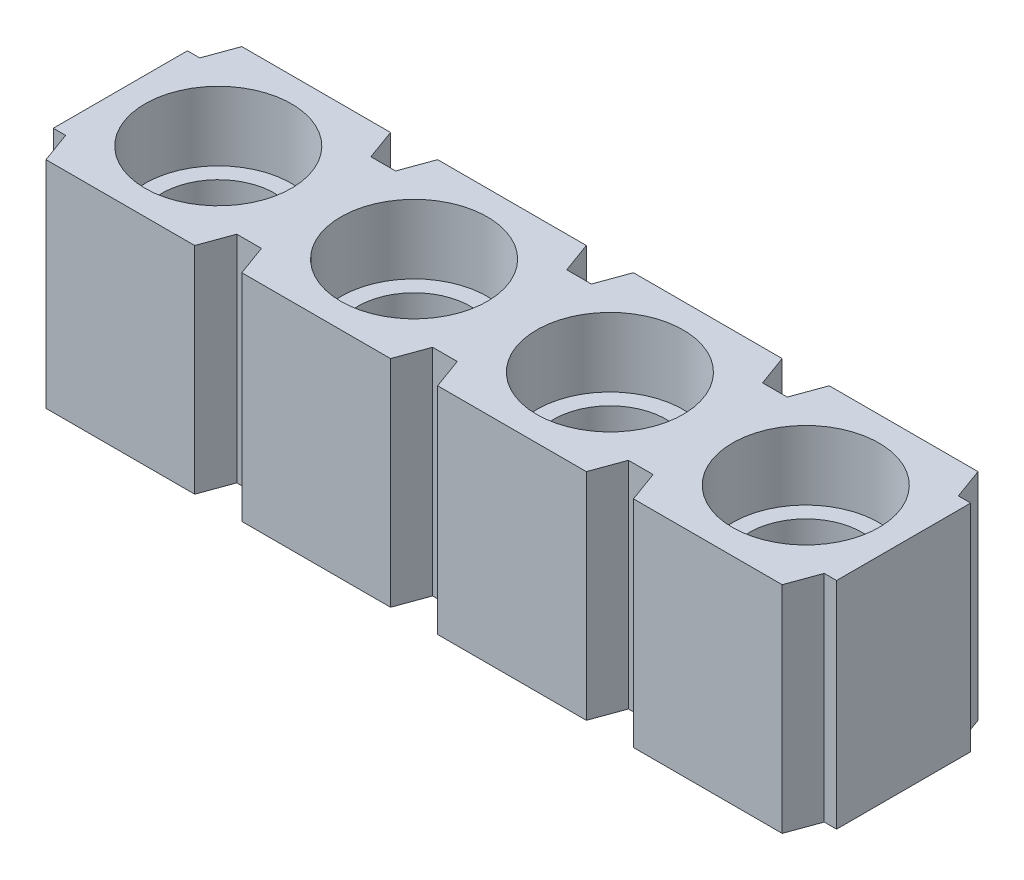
ISO-10303-21;
HEADER;
FILE_DESCRIPTION(('STEP AP214'),'2;1');
FILE_NAME('part.step','',(''),(''),'','','');
FILE_SCHEMA(('AUTOMOTIVE_DESIGN { 1 0 10303 214 1 1 1 1 }'));
ENDSEC;
DATA;
#1=APPLICATION_CONTEXT('core data for automotive mechanical design processes');
#2=APPLICATION_PROTOCOL_DEFINITION('international standard','automotive_design',2000,#1);
#3=PRODUCT_CONTEXT('',#1,'mechanical');
#4=PRODUCT('Part','Part','',(#3));
#5=PRODUCT_RELATED_PRODUCT_CATEGORY('part','',(#4));
#6=PRODUCT_DEFINITION_FORMATION('','',#4);
#7=PRODUCT_DEFINITION_CONTEXT('part definition',#1,'design');
#8=PRODUCT_DEFINITION('design','',#6,#7);
#9=PRODUCT_DEFINITION_SHAPE('','',#8);
#10=(LENGTH_UNIT() NAMED_UNIT(*) SI_UNIT(.MILLI.,.METRE.));
#11=(NAMED_UNIT(*) PLANE_ANGLE_UNIT() SI_UNIT($,.RADIAN.));
#12=(NAMED_UNIT(*) SI_UNIT($,.STERADIAN.) SOLID_ANGLE_UNIT());
#13=UNCERTAINTY_MEASURE_WITH_UNIT(LENGTH_MEASURE(1.E-05),#10,'distance_accuracy_value','');
#14=(GEOMETRIC_REPRESENTATION_CONTEXT(3) GLOBAL_UNCERTAINTY_ASSIGNED_CONTEXT((#13)) GLOBAL_UNIT_ASSIGNED_CONTEXT((#10,
#11,#12)) REPRESENTATION_CONTEXT('',''));
#15=CARTESIAN_POINT('',(0.,0.,0.));
#16=DIRECTION('',(0.,0.,1.));
#17=DIRECTION('',(1.,0.,0.));
#18=AXIS2_PLACEMENT_3D('',#15,#16,#17);
#19=CARTESIAN_POINT('',(9.54874741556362,-2.794,-2.54));
#20=DIRECTION('',(0.,0.,-1.));
#21=DIRECTION('',(-1.,0.,0.));
#22=AXIS2_PLACEMENT_3D('',#19,#20,#21);
#23=PLANE('',#22);
#24=DIRECTION('',(0.,1.,0.));
#25=VECTOR('',#24,1.);
#26=CARTESIAN_POINT('',(7.00877281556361,-2.794,-2.54));
#27=LINE('',#26,#25);
#28=CARTESIAN_POINT('',(7.00877281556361,-2.794,-2.54));
#29=VERTEX_POINT('',#28);
#30=CARTESIAN_POINT('',(7.00877281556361,0.,-2.54));
#31=VERTEX_POINT('',#30);
#32=EDGE_CURVE('E279',#29,#31,#27,.T.);
#33=ORIENTED_EDGE('',*,*,#32,.F.);
#34=DIRECTION('',(-1.,0.,0.));
#35=VECTOR('',#34,1.);
#36=CARTESIAN_POINT('',(9.54874741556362,-2.794,-2.54));
#37=LINE('',#36,#35);
#38=CARTESIAN_POINT('',(5.0799746,-2.794,-2.54));
#39=VERTEX_POINT('',#38);
#40=EDGE_CURVE('E270',#29,#39,#37,.T.);
#41=ORIENTED_EDGE('',*,*,#40,.T.);
#42=DIRECTION('',(0.,1.,0.));
#43=VECTOR('',#42,1.);
#44=CARTESIAN_POINT('',(5.0799746,-2.794,-2.54));
#45=LINE('',#44,#43);
#46=CARTESIAN_POINT('',(5.0799746,0.,-2.54));
#47=VERTEX_POINT('',#46);
#48=EDGE_CURVE('E329',#39,#47,#45,.T.);
#49=ORIENTED_EDGE('',*,*,#48,.T.);
#50=DIRECTION('',(-1.,0.,0.));
#51=VECTOR('',#50,1.);
#52=CARTESIAN_POINT('',(9.54874741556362,0.,-2.54));
#53=LINE('',#52,#51);
#54=EDGE_CURVE('E542',#31,#47,#53,.T.);
#55=ORIENTED_EDGE('',*,*,#54,.F.);
#56=EDGE_LOOP('',(#33,#41,#49,#55));
#57=FACE_BOUND('',#56,.T.);
#58=ADVANCED_FACE('F15',(#57),#23,.T.);
#59=CARTESIAN_POINT('',(0.,-2.794,0.));
#60=DIRECTION('',(0.,0.,1.));
#61=DIRECTION('',(1.,0.,0.));
#62=AXIS2_PLACEMENT_3D('',#59,#60,#61);
#63=PLANE('',#62);
#64=DIRECTION('',(0.,1.,0.));
#65=VECTOR('',#64,1.);
#66=CARTESIAN_POINT('',(7.6199746,-2.794,0.));
#67=LINE('',#66,#65);
#68=CARTESIAN_POINT('',(7.6199746,-2.794,0.));
#69=VERTEX_POINT('',#68);
#70=CARTESIAN_POINT('',(7.6199746,0.,0.));
#71=VERTEX_POINT('',#70);
#72=EDGE_CURVE('E301',#69,#71,#67,.T.);
#73=ORIENTED_EDGE('',*,*,#72,.F.);
#74=DIRECTION('',(1.,0.,0.));
#75=VECTOR('',#74,1.);
#76=CARTESIAN_POINT('',(0.,-2.794,0.));
#77=LINE('',#76,#75);
#78=CARTESIAN_POINT('',(9.54874741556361,-2.794,0.));
#79=VERTEX_POINT('',#78);
#80=EDGE_CURVE('E486',#69,#79,#77,.T.);
#81=ORIENTED_EDGE('',*,*,#80,.T.);
#82=DIRECTION('',(0.,1.,0.));
#83=VECTOR('',#82,1.);
#84=CARTESIAN_POINT('',(9.54874741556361,-2.794,0.));
#85=LINE('',#84,#83);
#86=CARTESIAN_POINT('',(9.54874741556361,0.,0.));
#87=VERTEX_POINT('',#86);
#88=EDGE_CURVE('E555',#79,#87,#85,.T.);
#89=ORIENTED_EDGE('',*,*,#88,.T.);
#90=DIRECTION('',(1.,0.,0.));
#91=VECTOR('',#90,1.);
#92=CARTESIAN_POINT('',(0.,0.,0.));
#93=LINE('',#92,#91);
#94=EDGE_CURVE('E522',#71,#87,#93,.T.);
#95=ORIENTED_EDGE('',*,*,#94,.F.);
#96=EDGE_LOOP('',(#73,#81,#89,#95));
#97=FACE_BOUND('',#96,.T.);
#98=ADVANCED_FACE('F628',(#97),#63,.T.);
#99=DIRECTION('',(0.,1.,0.));
#100=VECTOR('',#99,1.);
#101=CARTESIAN_POINT('',(4.46877281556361,-2.794,-2.54));
#102=LINE('',#101,#100);
#103=CARTESIAN_POINT('',(4.46877281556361,-2.794,-2.54));
#104=VERTEX_POINT('',#103);
#105=CARTESIAN_POINT('',(4.46877281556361,0.,-2.54));
#106=VERTEX_POINT('',#105);
#107=EDGE_CURVE('E326',#104,#106,#102,.T.);
#108=ORIENTED_EDGE('',*,*,#107,.F.);
#109=CARTESIAN_POINT('',(2.5399746,-2.794,-2.54));
#110=VERTEX_POINT('',#109);
#111=EDGE_CURVE('E823',#104,#110,#37,.T.);
#112=ORIENTED_EDGE('',*,*,#111,.T.);
#113=DIRECTION('',(0.,1.,0.));
#114=VECTOR('',#113,1.);
#115=CARTESIAN_POINT('',(2.5399746,-2.794,-2.54));
#116=LINE('',#115,#114);
#117=CARTESIAN_POINT('',(2.5399746,0.,-2.54));
#118=VERTEX_POINT('',#117);
#119=EDGE_CURVE('E420',#110,#118,#116,.T.);
#120=ORIENTED_EDGE('',*,*,#119,.T.);
#121=EDGE_CURVE('E580',#106,#118,#53,.T.);
#122=ORIENTED_EDGE('',*,*,#121,.F.);
#123=EDGE_LOOP('',(#108,#112,#120,#122));
#124=FACE_BOUND('',#123,.T.);
#125=ADVANCED_FACE('F697',(#124),#23,.T.);
#126=DIRECTION('',(0.,1.,0.));
#127=VECTOR('',#126,1.);
#128=CARTESIAN_POINT('',(7.00877281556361,-2.794,0.));
#129=LINE('',#128,#127);
#130=CARTESIAN_POINT('',(7.00877281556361,-2.794,0.));
#131=VERTEX_POINT('',#130);
#132=CARTESIAN_POINT('',(7.00877281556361,0.,0.));
#133=VERTEX_POINT('',#132);
#134=EDGE_CURVE('E304',#131,#133,#129,.T.);
#135=ORIENTED_EDGE('',*,*,#134,.T.);
#136=CARTESIAN_POINT('',(5.0799746,0.,0.));
#137=VERTEX_POINT('',#136);
#138=EDGE_CURVE('E617',#137,#133,#93,.T.);
#139=ORIENTED_EDGE('',*,*,#138,.F.);
#140=DIRECTION('',(0.,1.,0.));
#141=VECTOR('',#140,1.);
#142=CARTESIAN_POINT('',(5.0799746,-2.794,0.));
#143=LINE('',#142,#141);
#144=CARTESIAN_POINT('',(5.0799746,-2.794,0.));
#145=VERTEX_POINT('',#144);
#146=EDGE_CURVE('E352',#145,#137,#143,.T.);
#147=ORIENTED_EDGE('',*,*,#146,.F.);
#148=EDGE_CURVE('E658',#145,#131,#77,.T.);
#149=ORIENTED_EDGE('',*,*,#148,.T.);
#150=EDGE_LOOP('',(#135,#139,#147,#149));
#151=FACE_BOUND('',#150,.T.);
#152=ADVANCED_FACE('F672',(#151),#63,.T.);
#153=DIRECTION('',(0.,1.,0.));
#154=VECTOR('',#153,1.);
#155=CARTESIAN_POINT('',(1.92877281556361,-2.794,-2.54));
#156=LINE('',#155,#154);
#157=CARTESIAN_POINT('',(1.92877281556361,-2.794,-2.54));
#158=VERTEX_POINT('',#157);
#159=CARTESIAN_POINT('',(1.92877281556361,0.,-2.54));
#160=VERTEX_POINT('',#159);
#161=EDGE_CURVE('E417',#158,#160,#156,.T.);
#162=ORIENTED_EDGE('',*,*,#161,.F.);
#163=CARTESIAN_POINT('',(0.,-2.794,-2.54));
#164=VERTEX_POINT('',#163);
#165=EDGE_CURVE('E504',#158,#164,#37,.T.);
#166=ORIENTED_EDGE('',*,*,#165,.T.);
#167=DIRECTION('',(0.,1.,0.));
#168=VECTOR('',#167,1.);
#169=CARTESIAN_POINT('',(0.,-2.794,-2.54));
#170=LINE('',#169,#168);
#171=CARTESIAN_POINT('',(0.,0.,-2.54));
#172=VERTEX_POINT('',#171);
#173=EDGE_CURVE('E10',#164,#172,#170,.T.);
#174=ORIENTED_EDGE('',*,*,#173,.T.);
#175=EDGE_CURVE('E540',#160,#172,#53,.T.);
#176=ORIENTED_EDGE('',*,*,#175,.F.);
#177=EDGE_LOOP('',(#162,#166,#174,#176));
#178=FACE_BOUND('',#177,.T.);
#179=ADVANCED_FACE('F581',(#178),#23,.T.);
#180=DIRECTION('',(0.,1.,0.));
#181=VECTOR('',#180,1.);
#182=CARTESIAN_POINT('',(4.46877281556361,-2.794,0.));
#183=LINE('',#182,#181);
#184=CARTESIAN_POINT('',(4.46877281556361,-2.794,0.));
#185=VERTEX_POINT('',#184);
#186=CARTESIAN_POINT('',(4.46877281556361,0.,0.));
#187=VERTEX_POINT('',#186);
#188=EDGE_CURVE('E355',#185,#187,#183,.T.);
#189=ORIENTED_EDGE('',*,*,#188,.T.);
#190=CARTESIAN_POINT('',(2.5399746,0.,0.));
#191=VERTEX_POINT('',#190);
#192=EDGE_CURVE('E527',#191,#187,#93,.T.);
#193=ORIENTED_EDGE('',*,*,#192,.F.);
#194=DIRECTION('',(0.,1.,0.));
#195=VECTOR('',#194,1.);
#196=CARTESIAN_POINT('',(2.5399746,-2.794,0.));
#197=LINE('',#196,#195);
#198=CARTESIAN_POINT('',(2.5399746,-2.794,0.));
#199=VERTEX_POINT('',#198);
#200=EDGE_CURVE('E445',#199,#191,#197,.T.);
#201=ORIENTED_EDGE('',*,*,#200,.F.);
#202=EDGE_CURVE('E491',#199,#185,#77,.T.);
#203=ORIENTED_EDGE('',*,*,#202,.T.);
#204=EDGE_LOOP('',(#189,#193,#201,#203));
#205=FACE_BOUND('',#204,.T.);
#206=ADVANCED_FACE('F614',(#205),#63,.T.);
#207=CARTESIAN_POINT('',(0.,-2.794,-2.54));
#208=DIRECTION('',(-0.93969262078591,0.,-0.342020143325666));
#209=DIRECTION('',(-0.342020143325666,0.,0.93969262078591));
#210=AXIS2_PLACEMENT_3D('',#207,#208,#209);
#211=PLANE('',#210);
#212=DIRECTION('',(-0.342020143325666,0.,0.939692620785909));
#213=VECTOR('',#212,1.);
#214=CARTESIAN_POINT('',(0.,0.,-2.54));
#215=LINE('',#214,#213);
#216=CARTESIAN_POINT('',(-0.145606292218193,0.,-2.13995));
#217=VERTEX_POINT('',#216);
#218=EDGE_CURVE('E469',#172,#217,#215,.T.);
#219=ORIENTED_EDGE('',*,*,#218,.F.);
#220=ORIENTED_EDGE('',*,*,#173,.F.);
#221=DIRECTION('',(-0.342020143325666,0.,0.939692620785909));
#222=VECTOR('',#221,1.);
#223=CARTESIAN_POINT('',(0.,-2.794,-2.54));
#224=LINE('',#223,#222);
#225=CARTESIAN_POINT('',(-0.145606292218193,-2.794,-2.13995));
#226=VERTEX_POINT('',#225);
#227=EDGE_CURVE('E470',#164,#226,#224,.T.);
#228=ORIENTED_EDGE('',*,*,#227,.T.);
#229=DIRECTION('',(0.,1.,0.));
#230=VECTOR('',#229,1.);
#231=CARTESIAN_POINT('',(-0.145606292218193,-2.794,-2.13995));
#232=LINE('',#231,#230);
#233=EDGE_CURVE('E19',#226,#217,#232,.T.);
#234=ORIENTED_EDGE('',*,*,#233,.T.);
#235=EDGE_LOOP('',(#219,#220,#228,#234));
#236=FACE_BOUND('',#235,.T.);
#237=ADVANCED_FACE('F17',(#236),#211,.T.);
#238=DIRECTION('',(0.,1.,0.));
#239=VECTOR('',#238,1.);
#240=CARTESIAN_POINT('',(7.6199746,-2.794,-2.54));
#241=LINE('',#240,#239);
#242=CARTESIAN_POINT('',(7.6199746,-2.794,-2.54));
#243=VERTEX_POINT('',#242);
#244=CARTESIAN_POINT('',(7.6199746,0.,-2.54));
#245=VERTEX_POINT('',#244);
#246=EDGE_CURVE('E281',#243,#245,#241,.T.);
#247=ORIENTED_EDGE('',*,*,#246,.T.);
#248=CARTESIAN_POINT('',(9.54874741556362,0.,-2.54));
#249=VERTEX_POINT('',#248);
#250=EDGE_CURVE('E474',#249,#245,#53,.T.);
#251=ORIENTED_EDGE('',*,*,#250,.F.);
#252=DIRECTION('',(0.,1.,0.));
#253=VECTOR('',#252,1.);
#254=CARTESIAN_POINT('',(9.54874741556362,-2.794,-2.54));
#255=LINE('',#254,#253);
#256=CARTESIAN_POINT('',(9.54874741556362,-2.794,-2.54));
#257=VERTEX_POINT('',#256);
#258=EDGE_CURVE('E24',#257,#249,#255,.T.);
#259=ORIENTED_EDGE('',*,*,#258,.F.);
#260=EDGE_CURVE('E505',#257,#243,#37,.T.);
#261=ORIENTED_EDGE('',*,*,#260,.T.);
#262=EDGE_LOOP('',(#247,#251,#259,#261));
#263=FACE_BOUND('',#262,.T.);
#264=ADVANCED_FACE('F654',(#263),#23,.T.);
#265=CARTESIAN_POINT('',(9.54874741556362,-2.794,-2.54));
#266=DIRECTION('',(0.939692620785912,0.,-0.34202014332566));
#267=DIRECTION('',(-0.34202014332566,0.,-0.939692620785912));
#268=AXIS2_PLACEMENT_3D('',#265,#266,#267);
#269=PLANE('',#268);
#270=DIRECTION('',(-0.34202014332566,0.,-0.939692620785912));
#271=VECTOR('',#270,1.);
#272=CARTESIAN_POINT('',(9.54874741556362,0.,-2.54));
#273=LINE('',#272,#271);
#274=CARTESIAN_POINT('',(9.69435370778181,0.,-2.13995));
#275=VERTEX_POINT('',#274);
#276=EDGE_CURVE('E537',#275,#249,#273,.T.);
#277=ORIENTED_EDGE('',*,*,#276,.F.);
#278=DIRECTION('',(0.,1.,0.));
#279=VECTOR('',#278,1.);
#280=CARTESIAN_POINT('',(9.69435370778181,-2.794,-2.13995));
#281=LINE('',#280,#279);
#282=CARTESIAN_POINT('',(9.69435370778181,-2.794,-2.13995));
#283=VERTEX_POINT('',#282);
#284=EDGE_CURVE('E545',#283,#275,#281,.T.);
#285=ORIENTED_EDGE('',*,*,#284,.F.);
#286=DIRECTION('',(-0.34202014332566,0.,-0.939692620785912));
#287=VECTOR('',#286,1.);
#288=CARTESIAN_POINT('',(9.54874741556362,-2.794,-2.54));
#289=LINE('',#288,#287);
#290=EDGE_CURVE('E501',#283,#257,#289,.T.);
#291=ORIENTED_EDGE('',*,*,#290,.T.);
#292=ORIENTED_EDGE('',*,*,#258,.T.);
#293=EDGE_LOOP('',(#277,#285,#291,#292));
#294=FACE_BOUND('',#293,.T.);
#295=ADVANCED_FACE('F650',(#294),#269,.T.);
#296=CARTESIAN_POINT('',(9.85437370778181,-2.794,-2.13995));
#297=DIRECTION('',(0.,0.,-1.));
#298=DIRECTION('',(-1.,0.,0.));
#299=AXIS2_PLACEMENT_3D('',#296,#297,#298);
#300=PLANE('',#299);
#301=ORIENTED_EDGE('',*,*,#284,.T.);
#302=DIRECTION('',(-1.,0.,0.));
#303=VECTOR('',#302,1.);
#304=CARTESIAN_POINT('',(9.85437370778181,0.,-2.13995));
#305=LINE('',#304,#303);
#306=CARTESIAN_POINT('',(9.85437370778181,0.,-2.13995));
#307=VERTEX_POINT('',#306);
#308=EDGE_CURVE('E535',#307,#275,#305,.T.);
#309=ORIENTED_EDGE('',*,*,#308,.F.);
#310=DIRECTION('',(0.,1.,0.));
#311=VECTOR('',#310,1.);
#312=CARTESIAN_POINT('',(9.85437370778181,-2.794,-2.13995));
#313=LINE('',#312,#311);
#314=CARTESIAN_POINT('',(9.85437370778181,-2.794,-2.13995));
#315=VERTEX_POINT('',#314);
#316=EDGE_CURVE('E548',#315,#307,#313,.T.);
#317=ORIENTED_EDGE('',*,*,#316,.F.);
#318=DIRECTION('',(-1.,0.,0.));
#319=VECTOR('',#318,1.);
#320=CARTESIAN_POINT('',(9.85437370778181,-2.794,-2.13995));
#321=LINE('',#320,#319);
#322=EDGE_CURVE('E499',#315,#283,#321,.T.);
#323=ORIENTED_EDGE('',*,*,#322,.T.);
#324=EDGE_LOOP('',(#301,#309,#317,#323));
#325=FACE_BOUND('',#324,.T.);
#326=ADVANCED_FACE('F645',(#325),#300,.T.);
#327=CARTESIAN_POINT('',(9.85437370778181,-2.794,-2.13995));
#328=DIRECTION('',(1.,0.,0.));
#329=DIRECTION('',(0.,0.,-1.));
#330=AXIS2_PLACEMENT_3D('',#327,#328,#329);
#331=PLANE('',#330);
#332=DIRECTION('',(0.,0.,-1.));
#333=VECTOR('',#332,1.);
#334=CARTESIAN_POINT('',(9.85437370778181,0.,-2.13995));
#335=LINE('',#334,#333);
#336=CARTESIAN_POINT('',(9.85437370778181,0.,-0.40005));
#337=VERTEX_POINT('',#336);
#338=EDGE_CURVE('E532',#337,#307,#335,.T.);
#339=ORIENTED_EDGE('',*,*,#338,.F.);
#340=DIRECTION('',(0.,1.,0.));
#341=VECTOR('',#340,1.);
#342=CARTESIAN_POINT('',(9.85437370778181,-2.794,-0.40005));
#343=LINE('',#342,#341);
#344=CARTESIAN_POINT('',(9.85437370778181,-2.794,-0.40005));
#345=VERTEX_POINT('',#344);
#346=EDGE_CURVE('E550',#345,#337,#343,.T.);
#347=ORIENTED_EDGE('',*,*,#346,.F.);
#348=DIRECTION('',(0.,0.,-1.));
#349=VECTOR('',#348,1.);
#350=CARTESIAN_POINT('',(9.85437370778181,-2.794,-2.13995));
#351=LINE('',#350,#349);
#352=EDGE_CURVE('E496',#345,#315,#351,.T.);
#353=ORIENTED_EDGE('',*,*,#352,.T.);
#354=ORIENTED_EDGE('',*,*,#316,.T.);
#355=EDGE_LOOP('',(#339,#347,#353,#354));
#356=FACE_BOUND('',#355,.T.);
#357=ADVANCED_FACE('F641',(#356),#331,.T.);
#358=CARTESIAN_POINT('',(9.85437370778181,-2.794,-0.40005));
#359=DIRECTION('',(0.,0.,1.));
#360=DIRECTION('',(1.,0.,0.));
#361=AXIS2_PLACEMENT_3D('',#358,#359,#360);
#362=PLANE('',#361);
#363=DIRECTION('',(1.,0.,0.));
#364=VECTOR('',#363,1.);
#365=CARTESIAN_POINT('',(9.85437370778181,-2.794,-0.40005));
#366=LINE('',#365,#364);
#367=CARTESIAN_POINT('',(9.69435370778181,-2.794,-0.40005));
#368=VERTEX_POINT('',#367);
#369=EDGE_CURVE('E494',#368,#345,#366,.T.);
#370=ORIENTED_EDGE('',*,*,#369,.T.);
#371=ORIENTED_EDGE('',*,*,#346,.T.);
#372=DIRECTION('',(1.,0.,0.));
#373=VECTOR('',#372,1.);
#374=CARTESIAN_POINT('',(9.85437370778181,0.,-0.40005));
#375=LINE('',#374,#373);
#376=CARTESIAN_POINT('',(9.69435370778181,0.,-0.40005));
#377=VERTEX_POINT('',#376);
#378=EDGE_CURVE('E530',#377,#337,#375,.T.);
#379=ORIENTED_EDGE('',*,*,#378,.F.);
#380=DIRECTION('',(0.,1.,0.));
#381=VECTOR('',#380,1.);
#382=CARTESIAN_POINT('',(9.69435370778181,-2.794,-0.40005));
#383=LINE('',#382,#381);
#384=EDGE_CURVE('E553',#368,#377,#383,.T.);
#385=ORIENTED_EDGE('',*,*,#384,.F.);
#386=EDGE_LOOP('',(#370,#371,#379,#385));
#387=FACE_BOUND('',#386,.T.);
#388=ADVANCED_FACE('F636',(#387),#362,.T.);
#389=CARTESIAN_POINT('',(9.54874741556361,-2.794,0.));
#390=DIRECTION('',(0.939692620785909,0.,0.342020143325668));
#391=DIRECTION('',(0.342020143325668,0.,-0.939692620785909));
#392=AXIS2_PLACEMENT_3D('',#389,#390,#391);
#393=PLANE('',#392);
#394=DIRECTION('',(0.342020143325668,0.,-0.939692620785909));
#395=VECTOR('',#394,1.);
#396=CARTESIAN_POINT('',(9.54874741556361,0.,0.));
#397=LINE('',#396,#395);
#398=EDGE_CURVE('E526',#87,#377,#397,.T.);
#399=ORIENTED_EDGE('',*,*,#398,.F.);
#400=ORIENTED_EDGE('',*,*,#88,.F.);
#401=DIRECTION('',(0.342020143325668,0.,-0.939692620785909));
#402=VECTOR('',#401,1.);
#403=CARTESIAN_POINT('',(9.54874741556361,-2.794,0.));
#404=LINE('',#403,#402);
#405=EDGE_CURVE('E490',#79,#368,#404,.T.);
#406=ORIENTED_EDGE('',*,*,#405,.T.);
#407=ORIENTED_EDGE('',*,*,#384,.T.);
#408=EDGE_LOOP('',(#399,#400,#406,#407));
#409=FACE_BOUND('',#408,.T.);
#410=ADVANCED_FACE('F632',(#409),#393,.T.);
#411=DIRECTION('',(0.,1.,0.));
#412=VECTOR('',#411,1.);
#413=CARTESIAN_POINT('',(1.92877281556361,-2.794,0.));
#414=LINE('',#413,#412);
#415=CARTESIAN_POINT('',(1.92877281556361,-2.794,0.));
#416=VERTEX_POINT('',#415);
#417=CARTESIAN_POINT('',(1.92877281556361,0.,0.));
#418=VERTEX_POINT('',#417);
#419=EDGE_CURVE('E449',#416,#418,#414,.T.);
#420=ORIENTED_EDGE('',*,*,#419,.T.);
#421=CARTESIAN_POINT('',(0.,0.,0.));
#422=VERTEX_POINT('',#421);
#423=EDGE_CURVE('E523',#422,#418,#93,.T.);
#424=ORIENTED_EDGE('',*,*,#423,.F.);
#425=DIRECTION('',(0.,1.,0.));
#426=VECTOR('',#425,1.);
#427=CARTESIAN_POINT('',(0.,-2.794,0.));
#428=LINE('',#427,#426);
#429=CARTESIAN_POINT('',(0.,-2.794,0.));
#430=VERTEX_POINT('',#429);
#431=EDGE_CURVE('E558',#430,#422,#428,.T.);
#432=ORIENTED_EDGE('',*,*,#431,.F.);
#433=EDGE_CURVE('E487',#430,#416,#77,.T.);
#434=ORIENTED_EDGE('',*,*,#433,.T.);
#435=EDGE_LOOP('',(#420,#424,#432,#434));
#436=FACE_BOUND('',#435,.T.);
#437=ADVANCED_FACE('F597',(#436),#63,.T.);
#438=CARTESIAN_POINT('',(0.,-2.794,0.));
#439=DIRECTION('',(-0.939692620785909,0.,0.342020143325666));
#440=DIRECTION('',(0.342020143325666,0.,0.939692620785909));
#441=AXIS2_PLACEMENT_3D('',#438,#439,#440);
#442=PLANE('',#441);
#443=DIRECTION('',(0.342020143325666,0.,0.939692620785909));
#444=VECTOR('',#443,1.);
#445=CARTESIAN_POINT('',(0.,0.,0.));
#446=LINE('',#445,#444);
#447=CARTESIAN_POINT('',(-0.145606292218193,0.,-0.40005));
#448=VERTEX_POINT('',#447);
#449=EDGE_CURVE('E519',#448,#422,#446,.T.);
#450=ORIENTED_EDGE('',*,*,#449,.F.);
#451=DIRECTION('',(0.,1.,0.));
#452=VECTOR('',#451,1.);
#453=CARTESIAN_POINT('',(-0.145606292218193,-2.794,-0.40005));
#454=LINE('',#453,#452);
#455=CARTESIAN_POINT('',(-0.145606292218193,-2.794,-0.40005));
#456=VERTEX_POINT('',#455);
#457=EDGE_CURVE('E560',#456,#448,#454,.T.);
#458=ORIENTED_EDGE('',*,*,#457,.F.);
#459=DIRECTION('',(0.342020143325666,0.,0.939692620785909));
#460=VECTOR('',#459,1.);
#461=CARTESIAN_POINT('',(0.,-2.794,0.));
#462=LINE('',#461,#460);
#463=EDGE_CURVE('E483',#456,#430,#462,.T.);
#464=ORIENTED_EDGE('',*,*,#463,.T.);
#465=ORIENTED_EDGE('',*,*,#431,.T.);
#466=EDGE_LOOP('',(#450,#458,#464,#465));
#467=FACE_BOUND('',#466,.T.);
#468=ADVANCED_FACE('F593',(#467),#442,.T.);
#469=CARTESIAN_POINT('',(-0.305626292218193,-2.794,-0.40005));
#470=DIRECTION('',(0.,0.,1.));
#471=DIRECTION('',(1.,0.,0.));
#472=AXIS2_PLACEMENT_3D('',#469,#470,#471);
#473=PLANE('',#472);
#474=DIRECTION('',(1.,0.,0.));
#475=VECTOR('',#474,1.);
#476=CARTESIAN_POINT('',(-0.305626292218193,0.,-0.40005));
#477=LINE('',#476,#475);
#478=CARTESIAN_POINT('',(-0.305626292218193,0.,-0.40005));
#479=VERTEX_POINT('',#478);
#480=EDGE_CURVE('E516',#479,#448,#477,.T.);
#481=ORIENTED_EDGE('',*,*,#480,.F.);
#482=DIRECTION('',(0.,1.,0.));
#483=VECTOR('',#482,1.);
#484=CARTESIAN_POINT('',(-0.305626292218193,-2.794,-0.40005));
#485=LINE('',#484,#483);
#486=CARTESIAN_POINT('',(-0.305626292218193,-2.794,-0.40005));
#487=VERTEX_POINT('',#486);
#488=EDGE_CURVE('E562',#487,#479,#485,.T.);
#489=ORIENTED_EDGE('',*,*,#488,.F.);
#490=DIRECTION('',(1.,0.,0.));
#491=VECTOR('',#490,1.);
#492=CARTESIAN_POINT('',(-0.305626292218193,-2.794,-0.40005));
#493=LINE('',#492,#491);
#494=EDGE_CURVE('E480',#487,#456,#493,.T.);
#495=ORIENTED_EDGE('',*,*,#494,.T.);
#496=ORIENTED_EDGE('',*,*,#457,.T.);
#497=EDGE_LOOP('',(#481,#489,#495,#496));
#498=FACE_BOUND('',#497,.T.);
#499=ADVANCED_FACE('F591',(#498),#473,.T.);
#500=CARTESIAN_POINT('',(-0.305626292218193,-2.794,-2.13995));
#501=DIRECTION('',(-1.,0.,0.));
#502=DIRECTION('',(0.,0.,1.));
#503=AXIS2_PLACEMENT_3D('',#500,#501,#502);
#504=PLANE('',#503);
#505=DIRECTION('',(0.,0.,1.));
#506=VECTOR('',#505,1.);
#507=CARTESIAN_POINT('',(-0.305626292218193,0.,-2.13995));
#508=LINE('',#507,#506);
#509=CARTESIAN_POINT('',(-0.305626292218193,0.,-2.13995));
#510=VERTEX_POINT('',#509);
#511=EDGE_CURVE('E513',#510,#479,#508,.T.);
#512=ORIENTED_EDGE('',*,*,#511,.F.);
#513=DIRECTION('',(0.,1.,0.));
#514=VECTOR('',#513,1.);
#515=CARTESIAN_POINT('',(-0.305626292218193,-2.794,-2.13995));
#516=LINE('',#515,#514);
#517=CARTESIAN_POINT('',(-0.305626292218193,-2.794,-2.13995));
#518=VERTEX_POINT('',#517);
#519=EDGE_CURVE('E563',#518,#510,#516,.T.);
#520=ORIENTED_EDGE('',*,*,#519,.F.);
#521=DIRECTION('',(0.,0.,1.));
#522=VECTOR('',#521,1.);
#523=CARTESIAN_POINT('',(-0.305626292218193,-2.794,-2.13995));
#524=LINE('',#523,#522);
#525=EDGE_CURVE('E477',#518,#487,#524,.T.);
#526=ORIENTED_EDGE('',*,*,#525,.T.);
#527=ORIENTED_EDGE('',*,*,#488,.T.);
#528=EDGE_LOOP('',(#512,#520,#526,#527));
#529=FACE_BOUND('',#528,.T.);
#530=ADVANCED_FACE('F587',(#529),#504,.T.);
#531=CARTESIAN_POINT('',(-0.305626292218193,-2.794,-2.13995));
#532=DIRECTION('',(0.,0.,-1.));
#533=DIRECTION('',(-1.,0.,0.));
#534=AXIS2_PLACEMENT_3D('',#531,#532,#533);
#535=PLANE('',#534);
#536=DIRECTION('',(-1.,0.,0.));
#537=VECTOR('',#536,1.);
#538=CARTESIAN_POINT('',(-0.305626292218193,0.,-2.13995));
#539=LINE('',#538,#537);
#540=EDGE_CURVE('E510',#217,#510,#539,.T.);
#541=ORIENTED_EDGE('',*,*,#540,.F.);
#542=ORIENTED_EDGE('',*,*,#233,.F.);
#543=DIRECTION('',(-1.,0.,0.));
#544=VECTOR('',#543,1.);
#545=CARTESIAN_POINT('',(-0.305626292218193,-2.794,-2.13995));
#546=LINE('',#545,#544);
#547=EDGE_CURVE('E473',#226,#518,#546,.T.);
#548=ORIENTED_EDGE('',*,*,#547,.T.);
#549=ORIENTED_EDGE('',*,*,#519,.T.);
#550=EDGE_LOOP('',(#541,#542,#548,#549));
#551=FACE_BOUND('',#550,.T.);
#552=ADVANCED_FACE('F572',(#551),#535,.T.);
#553=CARTESIAN_POINT('',(0.,-2.794,-2.54));
#554=DIRECTION('',(0.,-1.,0.));
#555=DIRECTION('',(0.,0.,-1.));
#556=AXIS2_PLACEMENT_3D('',#553,#554,#555);
#557=PLANE('',#556);
#558=DIRECTION('',(0.342020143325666,0.,0.939692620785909));
#559=VECTOR('',#558,1.);
#560=CARTESIAN_POINT('',(7.15437910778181,-2.794,-2.13994999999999));
#561=LINE('',#560,#559);
#562=CARTESIAN_POINT('',(7.15437910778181,-2.794,-2.13994999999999));
#563=VERTEX_POINT('',#562);
#564=EDGE_CURVE('E251',#29,#563,#561,.T.);
#565=ORIENTED_EDGE('',*,*,#564,.T.);
#566=DIRECTION('',(1.,0.,0.));
#567=VECTOR('',#566,1.);
#568=CARTESIAN_POINT('',(7.15437910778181,-2.794,-2.13994999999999));
#569=LINE('',#568,#567);
#570=CARTESIAN_POINT('',(7.47436830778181,-2.794,-2.13994999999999));
#571=VERTEX_POINT('',#570);
#572=EDGE_CURVE('E260',#563,#571,#569,.T.);
#573=ORIENTED_EDGE('',*,*,#572,.T.);
#574=DIRECTION('',(0.342020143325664,0.,-0.93969262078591));
#575=VECTOR('',#574,1.);
#576=CARTESIAN_POINT('',(7.47436830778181,-2.794,-2.13994999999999));
#577=LINE('',#576,#575);
#578=EDGE_CURVE('E257',#571,#243,#577,.T.);
#579=ORIENTED_EDGE('',*,*,#578,.T.);
#580=ORIENTED_EDGE('',*,*,#260,.F.);
#581=ORIENTED_EDGE('',*,*,#290,.F.);
#582=ORIENTED_EDGE('',*,*,#322,.F.);
#583=ORIENTED_EDGE('',*,*,#352,.F.);
#584=ORIENTED_EDGE('',*,*,#369,.F.);
#585=ORIENTED_EDGE('',*,*,#405,.F.);
#586=ORIENTED_EDGE('',*,*,#80,.F.);
#587=DIRECTION('',(-0.342020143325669,0.,-0.939692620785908));
#588=VECTOR('',#587,1.);
#589=CARTESIAN_POINT('',(7.47436830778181,-2.794,-0.40005));
#590=LINE('',#589,#588);
#591=CARTESIAN_POINT('',(7.47436830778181,-2.794,-0.40005));
#592=VERTEX_POINT('',#591);
#593=EDGE_CURVE('E285',#69,#592,#590,.T.);
#594=ORIENTED_EDGE('',*,*,#593,.T.);
#595=DIRECTION('',(-1.,0.,0.));
#596=VECTOR('',#595,1.);
#597=CARTESIAN_POINT('',(7.15437910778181,-2.794,-0.40005));
#598=LINE('',#597,#596);
#599=CARTESIAN_POINT('',(7.15437910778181,-2.794,-0.40005));
#600=VERTEX_POINT('',#599);
#601=EDGE_CURVE('E288',#592,#600,#598,.T.);
#602=ORIENTED_EDGE('',*,*,#601,.T.);
#603=DIRECTION('',(-0.342020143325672,0.,0.939692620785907));
#604=VECTOR('',#603,1.);
#605=CARTESIAN_POINT('',(7.15437910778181,-2.794,-0.40005));
#606=LINE('',#605,#604);
#607=EDGE_CURVE('E292',#600,#131,#606,.T.);
#608=ORIENTED_EDGE('',*,*,#607,.T.);
#609=ORIENTED_EDGE('',*,*,#148,.F.);
#610=DIRECTION('',(-0.342020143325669,0.,-0.939692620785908));
#611=VECTOR('',#610,1.);
#612=CARTESIAN_POINT('',(4.93436830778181,-2.794,-0.40005));
#613=LINE('',#612,#611);
#614=CARTESIAN_POINT('',(4.93436830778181,-2.794,-0.40005));
#615=VERTEX_POINT('',#614);
#616=EDGE_CURVE('E336',#145,#615,#613,.T.);
#617=ORIENTED_EDGE('',*,*,#616,.T.);
#618=DIRECTION('',(-1.,0.,0.));
#619=VECTOR('',#618,1.);
#620=CARTESIAN_POINT('',(4.61437910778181,-2.794,-0.40005));
#621=LINE('',#620,#619);
#622=CARTESIAN_POINT('',(4.61437910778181,-2.794,-0.40005));
#623=VERTEX_POINT('',#622);
#624=EDGE_CURVE('E339',#615,#623,#621,.T.);
#625=ORIENTED_EDGE('',*,*,#624,.T.);
#626=DIRECTION('',(-0.342020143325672,0.,0.939692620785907));
#627=VECTOR('',#626,1.);
#628=CARTESIAN_POINT('',(4.61437910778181,-2.794,-0.40005));
#629=LINE('',#628,#627);
#630=EDGE_CURVE('E343',#623,#185,#629,.T.);
#631=ORIENTED_EDGE('',*,*,#630,.T.);
#632=ORIENTED_EDGE('',*,*,#202,.F.);
#633=DIRECTION('',(-0.342020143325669,0.,-0.939692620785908));
#634=VECTOR('',#633,1.);
#635=CARTESIAN_POINT('',(2.39436830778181,-2.794,-0.40005));
#636=LINE('',#635,#634);
#637=CARTESIAN_POINT('',(2.39436830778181,-2.794,-0.40005));
#638=VERTEX_POINT('',#637);
#639=EDGE_CURVE('E429',#199,#638,#636,.T.);
#640=ORIENTED_EDGE('',*,*,#639,.T.);
#641=DIRECTION('',(-1.,0.,0.));
#642=VECTOR('',#641,1.);
#643=CARTESIAN_POINT('',(2.07437910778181,-2.794,-0.40005));
#644=LINE('',#643,#642);
#645=CARTESIAN_POINT('',(2.07437910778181,-2.794,-0.40005));
#646=VERTEX_POINT('',#645);
#647=EDGE_CURVE('E432',#638,#646,#644,.T.);
#648=ORIENTED_EDGE('',*,*,#647,.T.);
#649=DIRECTION('',(-0.342020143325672,0.,0.939692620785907));
#650=VECTOR('',#649,1.);
#651=CARTESIAN_POINT('',(2.07437910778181,-2.794,-0.40005));
#652=LINE('',#651,#650);
#653=EDGE_CURVE('E436',#646,#416,#652,.T.);
#654=ORIENTED_EDGE('',*,*,#653,.T.);
#655=ORIENTED_EDGE('',*,*,#433,.F.);
#656=ORIENTED_EDGE('',*,*,#463,.F.);
#657=ORIENTED_EDGE('',*,*,#494,.F.);
#658=ORIENTED_EDGE('',*,*,#525,.F.);
#659=ORIENTED_EDGE('',*,*,#547,.F.);
#660=ORIENTED_EDGE('',*,*,#227,.F.);
#661=ORIENTED_EDGE('',*,*,#165,.F.);
#662=DIRECTION('',(0.342020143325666,0.,0.939692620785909));
#663=VECTOR('',#662,1.);
#664=CARTESIAN_POINT('',(2.07437910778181,-2.794,-2.13994999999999));
#665=LINE('',#664,#663);
#666=CARTESIAN_POINT('',(2.07437910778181,-2.794,-2.13994999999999));
#667=VERTEX_POINT('',#666);
#668=EDGE_CURVE('E400',#158,#667,#665,.T.);
#669=ORIENTED_EDGE('',*,*,#668,.T.);
#670=DIRECTION('',(1.,0.,0.));
#671=VECTOR('',#670,1.);
#672=CARTESIAN_POINT('',(2.07437910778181,-2.794,-2.13994999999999));
#673=LINE('',#672,#671);
#674=CARTESIAN_POINT('',(2.39436830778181,-2.794,-2.13994999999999));
#675=VERTEX_POINT('',#674);
#676=EDGE_CURVE('E403',#667,#675,#673,.T.);
#677=ORIENTED_EDGE('',*,*,#676,.T.);
#678=DIRECTION('',(0.342020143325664,0.,-0.93969262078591));
#679=VECTOR('',#678,1.);
#680=CARTESIAN_POINT('',(2.39436830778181,-2.794,-2.13994999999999));
#681=LINE('',#680,#679);
#682=EDGE_CURVE('E407',#675,#110,#681,.T.);
#683=ORIENTED_EDGE('',*,*,#682,.T.);
#684=ORIENTED_EDGE('',*,*,#111,.F.);
#685=DIRECTION('',(0.342020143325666,0.,0.939692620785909));
#686=VECTOR('',#685,1.);
#687=CARTESIAN_POINT('',(4.61437910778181,-2.794,-2.13994999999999));
#688=LINE('',#687,#686);
#689=CARTESIAN_POINT('',(4.61437910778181,-2.794,-2.13994999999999));
#690=VERTEX_POINT('',#689);
#691=EDGE_CURVE('E310',#104,#690,#688,.T.);
#692=ORIENTED_EDGE('',*,*,#691,.T.);
#693=DIRECTION('',(1.,0.,0.));
#694=VECTOR('',#693,1.);
#695=CARTESIAN_POINT('',(4.61437910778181,-2.794,-2.13994999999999));
#696=LINE('',#695,#694);
#697=CARTESIAN_POINT('',(4.93436830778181,-2.794,-2.13994999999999));
#698=VERTEX_POINT('',#697);
#699=EDGE_CURVE('E313',#690,#698,#696,.T.);
#700=ORIENTED_EDGE('',*,*,#699,.T.);
#701=DIRECTION('',(0.342020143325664,0.,-0.93969262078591));
#702=VECTOR('',#701,1.);
#703=CARTESIAN_POINT('',(4.93436830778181,-2.794,-2.13994999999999));
#704=LINE('',#703,#702);
#705=EDGE_CURVE('E317',#698,#39,#704,.T.);
#706=ORIENTED_EDGE('',*,*,#705,.T.);
#707=ORIENTED_EDGE('',*,*,#40,.F.);
#708=EDGE_LOOP('',(#565,#573,#579,#580,#581,#582,#583,#584,#585,#586,#594,#602,#608,#609,#617,
#625,#631,#632,#640,#648,#654,#655,#656,#657,#658,#659,#660,#661,#669,#677,#683,#684,#692,#700,
#706,#707));
#709=FACE_BOUND('',#708,.T.);
#710=CARTESIAN_POINT('',(8.58437370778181,-2.794,-1.27));
#711=DIRECTION('',(0.,1.,0.));
#712=DIRECTION('',(0.,0.,1.));
#713=AXIS2_PLACEMENT_3D('',#710,#711,#712);
#714=CIRCLE('',#713,0.729996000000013);
#715=CARTESIAN_POINT('',(8.58437370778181,-2.794,-0.540003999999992));
#716=VERTEX_POINT('',#715);
#717=EDGE_CURVE('E364',#716,#716,#714,.T.);
#718=ORIENTED_EDGE('',*,*,#717,.T.);
#719=EDGE_LOOP('',(#718));
#720=FACE_BOUND('',#719,.T.);
#721=CARTESIAN_POINT('',(6.04437370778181,-2.794,-1.27));
#722=DIRECTION('',(0.,1.,0.));
#723=DIRECTION('',(0.,0.,1.));
#724=AXIS2_PLACEMENT_3D('',#721,#722,#723);
#725=CIRCLE('',#724,0.729996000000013);
#726=CARTESIAN_POINT('',(6.04437370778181,-2.794,-0.540003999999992));
#727=VERTEX_POINT('',#726);
#728=EDGE_CURVE('E376',#727,#727,#725,.T.);
#729=ORIENTED_EDGE('',*,*,#728,.T.);
#730=EDGE_LOOP('',(#729));
#731=FACE_BOUND('',#730,.T.);
#732=CARTESIAN_POINT('',(3.50437370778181,-2.794,-1.27));
#733=DIRECTION('',(0.,1.,0.));
#734=DIRECTION('',(0.,0.,1.));
#735=AXIS2_PLACEMENT_3D('',#732,#733,#734);
#736=CIRCLE('',#735,0.729996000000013);
#737=CARTESIAN_POINT('',(3.50437370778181,-2.794,-0.540003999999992));
#738=VERTEX_POINT('',#737);
#739=EDGE_CURVE('E388',#738,#738,#736,.T.);
#740=ORIENTED_EDGE('',*,*,#739,.T.);
#741=EDGE_LOOP('',(#740));
#742=FACE_BOUND('',#741,.T.);
#743=CARTESIAN_POINT('',(0.964373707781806,-2.794,-1.27));
#744=DIRECTION('',(0.,1.,0.));
#745=DIRECTION('',(0.,0.,1.));
#746=AXIS2_PLACEMENT_3D('',#743,#744,#745);
#747=CIRCLE('',#746,0.729996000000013);
#748=CARTESIAN_POINT('',(0.964373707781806,-2.794,-0.540003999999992));
#749=VERTEX_POINT('',#748);
#750=EDGE_CURVE('E466',#749,#749,#747,.T.);
#751=ORIENTED_EDGE('',*,*,#750,.T.);
#752=EDGE_LOOP('',(#751));
#753=FACE_BOUND('',#752,.T.);
#754=ADVANCED_FACE('F267',(#709,#720,#731,#742,#753),#557,.T.);
#755=CARTESIAN_POINT('',(0.,0.,-2.54));
#756=DIRECTION('',(0.,-1.,0.));
#757=DIRECTION('',(0.,0.,-1.));
#758=AXIS2_PLACEMENT_3D('',#755,#756,#757);
#759=PLANE('',#758);
#760=CARTESIAN_POINT('',(8.58437370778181,0.,-1.27));
#761=DIRECTION('',(0.,1.,0.));
#762=DIRECTION('',(0.,0.,1.));
#763=AXIS2_PLACEMENT_3D('',#760,#761,#762);
#764=CIRCLE('',#763,0.949960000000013);
#765=CARTESIAN_POINT('',(8.58437370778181,0.,-0.320039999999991));
#766=VERTEX_POINT('',#765);
#767=EDGE_CURVE('E354',#766,#766,#764,.T.);
#768=ORIENTED_EDGE('',*,*,#767,.F.);
#769=EDGE_LOOP('',(#768));
#770=FACE_BOUND('',#769,.T.);
#771=CARTESIAN_POINT('',(6.04437370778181,0.,-1.27));
#772=DIRECTION('',(0.,1.,0.));
#773=DIRECTION('',(0.,0.,1.));
#774=AXIS2_PLACEMENT_3D('',#771,#772,#773);
#775=CIRCLE('',#774,0.949960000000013);
#776=CARTESIAN_POINT('',(6.04437370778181,0.,-0.320039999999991));
#777=VERTEX_POINT('',#776);
#778=EDGE_CURVE('E373',#777,#777,#775,.T.);
#779=ORIENTED_EDGE('',*,*,#778,.F.);
#780=EDGE_LOOP('',(#779));
#781=FACE_BOUND('',#780,.T.);
#782=CARTESIAN_POINT('',(3.50437370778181,0.,-1.27));
#783=DIRECTION('',(0.,1.,0.));
#784=DIRECTION('',(0.,0.,1.));
#785=AXIS2_PLACEMENT_3D('',#782,#783,#784);
#786=CIRCLE('',#785,0.949960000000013);
#787=CARTESIAN_POINT('',(3.50437370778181,0.,-0.320039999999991));
#788=VERTEX_POINT('',#787);
#789=EDGE_CURVE('E385',#788,#788,#786,.T.);
#790=ORIENTED_EDGE('',*,*,#789,.F.);
#791=EDGE_LOOP('',(#790));
#792=FACE_BOUND('',#791,.T.);
#793=CARTESIAN_POINT('',(0.964373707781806,0.,-1.27));
#794=DIRECTION('',(0.,1.,0.));
#795=DIRECTION('',(0.,0.,1.));
#796=AXIS2_PLACEMENT_3D('',#793,#794,#795);
#797=CIRCLE('',#796,0.949960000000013);
#798=CARTESIAN_POINT('',(0.964373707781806,0.,-0.320039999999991));
#799=VERTEX_POINT('',#798);
#800=EDGE_CURVE('E448',#799,#799,#797,.T.);
#801=ORIENTED_EDGE('',*,*,#800,.F.);
#802=EDGE_LOOP('',(#801));
#803=FACE_BOUND('',#802,.T.);
#804=DIRECTION('',(1.,0.,0.));
#805=VECTOR('',#804,1.);
#806=CARTESIAN_POINT('',(7.15437910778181,0.,-2.13994999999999));
#807=LINE('',#806,#805);
#808=CARTESIAN_POINT('',(7.15437910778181,0.,-2.13994999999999));
#809=VERTEX_POINT('',#808);
#810=CARTESIAN_POINT('',(7.47436830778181,0.,-2.13994999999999));
#811=VERTEX_POINT('',#810);
#812=EDGE_CURVE('E273',#809,#811,#807,.T.);
#813=ORIENTED_EDGE('',*,*,#812,.F.);
#814=DIRECTION('',(0.342020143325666,0.,0.939692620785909));
#815=VECTOR('',#814,1.);
#816=CARTESIAN_POINT('',(7.15437910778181,0.,-2.13994999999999));
#817=LINE('',#816,#815);
#818=EDGE_CURVE('E32',#31,#809,#817,.T.);
#819=ORIENTED_EDGE('',*,*,#818,.F.);
#820=ORIENTED_EDGE('',*,*,#54,.T.);
#821=DIRECTION('',(0.342020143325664,0.,-0.93969262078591));
#822=VECTOR('',#821,1.);
#823=CARTESIAN_POINT('',(4.93436830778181,0.,-2.13994999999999));
#824=LINE('',#823,#822);
#825=CARTESIAN_POINT('',(4.93436830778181,0.,-2.13994999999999));
#826=VERTEX_POINT('',#825);
#827=EDGE_CURVE('E314',#826,#47,#824,.T.);
#828=ORIENTED_EDGE('',*,*,#827,.F.);
#829=DIRECTION('',(1.,0.,0.));
#830=VECTOR('',#829,1.);
#831=CARTESIAN_POINT('',(4.61437910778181,0.,-2.13994999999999));
#832=LINE('',#831,#830);
#833=CARTESIAN_POINT('',(4.61437910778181,0.,-2.13994999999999));
#834=VERTEX_POINT('',#833);
#835=EDGE_CURVE('E321',#834,#826,#832,.T.);
#836=ORIENTED_EDGE('',*,*,#835,.F.);
#837=DIRECTION('',(0.342020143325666,0.,0.939692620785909));
#838=VECTOR('',#837,1.);
#839=CARTESIAN_POINT('',(4.61437910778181,0.,-2.13994999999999));
#840=LINE('',#839,#838);
#841=EDGE_CURVE('E303',#106,#834,#840,.T.);
#842=ORIENTED_EDGE('',*,*,#841,.F.);
#843=ORIENTED_EDGE('',*,*,#121,.T.);
#844=DIRECTION('',(0.342020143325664,0.,-0.93969262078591));
#845=VECTOR('',#844,1.);
#846=CARTESIAN_POINT('',(2.39436830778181,0.,-2.13994999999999));
#847=LINE('',#846,#845);
#848=CARTESIAN_POINT('',(2.39436830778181,0.,-2.13994999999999));
#849=VERTEX_POINT('',#848);
#850=EDGE_CURVE('E404',#849,#118,#847,.T.);
#851=ORIENTED_EDGE('',*,*,#850,.F.);
#852=DIRECTION('',(1.,0.,0.));
#853=VECTOR('',#852,1.);
#854=CARTESIAN_POINT('',(2.07437910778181,0.,-2.13994999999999));
#855=LINE('',#854,#853);
#856=CARTESIAN_POINT('',(2.07437910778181,0.,-2.13994999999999));
#857=VERTEX_POINT('',#856);
#858=EDGE_CURVE('E412',#857,#849,#855,.T.);
#859=ORIENTED_EDGE('',*,*,#858,.F.);
#860=DIRECTION('',(0.342020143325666,0.,0.939692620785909));
#861=VECTOR('',#860,1.);
#862=CARTESIAN_POINT('',(2.07437910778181,0.,-2.13994999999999));
#863=LINE('',#862,#861);
#864=EDGE_CURVE('E399',#160,#857,#863,.T.);
#865=ORIENTED_EDGE('',*,*,#864,.F.);
#866=ORIENTED_EDGE('',*,*,#175,.T.);
#867=ORIENTED_EDGE('',*,*,#218,.T.);
#868=ORIENTED_EDGE('',*,*,#540,.T.);
#869=ORIENTED_EDGE('',*,*,#511,.T.);
#870=ORIENTED_EDGE('',*,*,#480,.T.);
#871=ORIENTED_EDGE('',*,*,#449,.T.);
#872=ORIENTED_EDGE('',*,*,#423,.T.);
#873=DIRECTION('',(-0.342020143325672,0.,0.939692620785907));
#874=VECTOR('',#873,1.);
#875=CARTESIAN_POINT('',(2.07437910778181,0.,-0.40005));
#876=LINE('',#875,#874);
#877=CARTESIAN_POINT('',(2.07437910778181,0.,-0.40005));
#878=VERTEX_POINT('',#877);
#879=EDGE_CURVE('E433',#878,#418,#876,.T.);
#880=ORIENTED_EDGE('',*,*,#879,.F.);
#881=DIRECTION('',(-1.,0.,0.));
#882=VECTOR('',#881,1.);
#883=CARTESIAN_POINT('',(2.07437910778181,0.,-0.40005));
#884=LINE('',#883,#882);
#885=CARTESIAN_POINT('',(2.39436830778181,0.,-0.40005));
#886=VERTEX_POINT('',#885);
#887=EDGE_CURVE('E441',#886,#878,#884,.T.);
#888=ORIENTED_EDGE('',*,*,#887,.F.);
#889=DIRECTION('',(-0.342020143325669,0.,-0.939692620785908));
#890=VECTOR('',#889,1.);
#891=CARTESIAN_POINT('',(2.39436830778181,0.,-0.40005));
#892=LINE('',#891,#890);
#893=EDGE_CURVE('E419',#191,#886,#892,.T.);
#894=ORIENTED_EDGE('',*,*,#893,.F.);
#895=ORIENTED_EDGE('',*,*,#192,.T.);
#896=DIRECTION('',(-0.342020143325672,0.,0.939692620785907));
#897=VECTOR('',#896,1.);
#898=CARTESIAN_POINT('',(4.61437910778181,0.,-0.40005));
#899=LINE('',#898,#897);
#900=CARTESIAN_POINT('',(4.61437910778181,0.,-0.40005));
#901=VERTEX_POINT('',#900);
#902=EDGE_CURVE('E340',#901,#187,#899,.T.);
#903=ORIENTED_EDGE('',*,*,#902,.F.);
#904=DIRECTION('',(-1.,0.,0.));
#905=VECTOR('',#904,1.);
#906=CARTESIAN_POINT('',(4.61437910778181,0.,-0.40005));
#907=LINE('',#906,#905);
#908=CARTESIAN_POINT('',(4.93436830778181,0.,-0.40005));
#909=VERTEX_POINT('',#908);
#910=EDGE_CURVE('E348',#909,#901,#907,.T.);
#911=ORIENTED_EDGE('',*,*,#910,.F.);
#912=DIRECTION('',(-0.342020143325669,0.,-0.939692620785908));
#913=VECTOR('',#912,1.);
#914=CARTESIAN_POINT('',(4.93436830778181,0.,-0.40005));
#915=LINE('',#914,#913);
#916=EDGE_CURVE('E328',#137,#909,#915,.T.);
#917=ORIENTED_EDGE('',*,*,#916,.F.);
#918=ORIENTED_EDGE('',*,*,#138,.T.);
#919=DIRECTION('',(-0.342020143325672,0.,0.939692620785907));
#920=VECTOR('',#919,1.);
#921=CARTESIAN_POINT('',(7.15437910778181,0.,-0.40005));
#922=LINE('',#921,#920);
#923=CARTESIAN_POINT('',(7.15437910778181,0.,-0.40005));
#924=VERTEX_POINT('',#923);
#925=EDGE_CURVE('E289',#924,#133,#922,.T.);
#926=ORIENTED_EDGE('',*,*,#925,.F.);
#927=DIRECTION('',(-1.,0.,0.));
#928=VECTOR('',#927,1.);
#929=CARTESIAN_POINT('',(7.15437910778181,0.,-0.40005));
#930=LINE('',#929,#928);
#931=CARTESIAN_POINT('',(7.47436830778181,0.,-0.40005));
#932=VERTEX_POINT('',#931);
#933=EDGE_CURVE('E297',#932,#924,#930,.T.);
#934=ORIENTED_EDGE('',*,*,#933,.F.);
#935=DIRECTION('',(-0.342020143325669,0.,-0.939692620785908));
#936=VECTOR('',#935,1.);
#937=CARTESIAN_POINT('',(7.47436830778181,0.,-0.40005));
#938=LINE('',#937,#936);
#939=EDGE_CURVE('E40',#71,#932,#938,.T.);
#940=ORIENTED_EDGE('',*,*,#939,.F.);
#941=ORIENTED_EDGE('',*,*,#94,.T.);
#942=ORIENTED_EDGE('',*,*,#398,.T.);
#943=ORIENTED_EDGE('',*,*,#378,.T.);
#944=ORIENTED_EDGE('',*,*,#338,.T.);
#945=ORIENTED_EDGE('',*,*,#308,.T.);
#946=ORIENTED_EDGE('',*,*,#276,.T.);
#947=ORIENTED_EDGE('',*,*,#250,.T.);
#948=DIRECTION('',(0.342020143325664,0.,-0.93969262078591));
#949=VECTOR('',#948,1.);
#950=CARTESIAN_POINT('',(7.47436830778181,0.,-2.13994999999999));
#951=LINE('',#950,#949);
#952=EDGE_CURVE('E271',#811,#245,#951,.T.);
#953=ORIENTED_EDGE('',*,*,#952,.F.);
#954=EDGE_LOOP('',(#813,#819,#820,#828,#836,#842,#843,#851,#859,#865,#866,#867,#868,#869,#870,
#871,#872,#880,#888,#894,#895,#903,#911,#917,#918,#926,#934,#940,#941,#942,#943,#944,#945,#946,
#947,#953));
#955=FACE_BOUND('',#954,.T.);
#956=ADVANCED_FACE('F574',(#770,#781,#792,#803,#955),#759,.F.);
#957=CARTESIAN_POINT('',(0.964373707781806,0.,-1.27));
#958=DIRECTION('',(0.,1.,0.));
#959=DIRECTION('',(0.,0.,1.));
#960=AXIS2_PLACEMENT_3D('',#957,#958,#959);
#961=CYLINDRICAL_SURFACE('',#960,0.729996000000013);
#962=ORIENTED_EDGE('',*,*,#750,.F.);
#963=EDGE_LOOP('',(#962));
#964=FACE_BOUND('',#963,.T.);
#965=CARTESIAN_POINT('',(0.964373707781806,-0.89408,-1.27));
#966=DIRECTION('',(0.,1.,0.));
#967=DIRECTION('',(0.,0.,1.));
#968=AXIS2_PLACEMENT_3D('',#965,#966,#967);
#969=CIRCLE('',#968,0.729996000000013);
#970=CARTESIAN_POINT('',(0.964373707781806,-0.89408,-0.540003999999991));
#971=VERTEX_POINT('',#970);
#972=EDGE_CURVE('E463',#971,#971,#969,.T.);
#973=ORIENTED_EDGE('',*,*,#972,.T.);
#974=EDGE_LOOP('',(#973));
#975=FACE_BOUND('',#974,.T.);
#976=ADVANCED_FACE('F737',(#964,#975),#961,.F.);
#977=CARTESIAN_POINT('',(1.69436970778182,-0.89408,-1.27));
#978=DIRECTION('',(0.,-1.,0.));
#979=DIRECTION('',(0.,0.,-1.));
#980=AXIS2_PLACEMENT_3D('',#977,#978,#979);
#981=PLANE('',#980);
#982=ORIENTED_EDGE('',*,*,#972,.F.);
#983=EDGE_LOOP('',(#982));
#984=FACE_BOUND('',#983,.T.);
#985=CARTESIAN_POINT('',(0.964373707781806,-0.89408,-1.27));
#986=DIRECTION('',(0.,1.,0.));
#987=DIRECTION('',(0.,0.,1.));
#988=AXIS2_PLACEMENT_3D('',#985,#986,#987);
#989=CIRCLE('',#988,0.949960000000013);
#990=CARTESIAN_POINT('',(0.964373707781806,-0.89408,-0.320039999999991));
#991=VERTEX_POINT('',#990);
#992=EDGE_CURVE('E460',#991,#991,#989,.T.);
#993=ORIENTED_EDGE('',*,*,#992,.T.);
#994=EDGE_LOOP('',(#993));
#995=FACE_BOUND('',#994,.T.);
#996=ADVANCED_FACE('F742',(#984,#995),#981,.F.);
#997=CARTESIAN_POINT('',(0.964373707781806,0.,-1.27));
#998=DIRECTION('',(0.,1.,0.));
#999=DIRECTION('',(0.,0.,1.));
#1000=AXIS2_PLACEMENT_3D('',#997,#998,#999);
#1001=CYLINDRICAL_SURFACE('',#1000,0.949960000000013);
#1002=ORIENTED_EDGE('',*,*,#992,.F.);
#1003=EDGE_LOOP('',(#1002));
#1004=FACE_BOUND('',#1003,.T.);
#1005=ORIENTED_EDGE('',*,*,#800,.T.);
#1006=EDGE_LOOP('',(#1005));
#1007=FACE_BOUND('',#1006,.T.);
#1008=ADVANCED_FACE('F746',(#1004,#1007),#1001,.F.);
#1009=CARTESIAN_POINT('',(2.39436830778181,-2.794,-0.40005));
#1010=DIRECTION('',(0.939692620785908,0.,-0.34202014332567));
#1011=DIRECTION('',(-0.34202014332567,0.,-0.939692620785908));
#1012=AXIS2_PLACEMENT_3D('',#1009,#1010,#1011);
#1013=PLANE('',#1012);
#1014=ORIENTED_EDGE('',*,*,#893,.T.);
#1015=DIRECTION('',(0.,1.,0.));
#1016=VECTOR('',#1015,1.);
#1017=CARTESIAN_POINT('',(2.39436830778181,-2.794,-0.40005));
#1018=LINE('',#1017,#1016);
#1019=EDGE_CURVE('E439',#638,#886,#1018,.T.);
#1020=ORIENTED_EDGE('',*,*,#1019,.F.);
#1021=ORIENTED_EDGE('',*,*,#639,.F.);
#1022=ORIENTED_EDGE('',*,*,#200,.T.);
#1023=EDGE_LOOP('',(#1014,#1020,#1021,#1022));
#1024=FACE_BOUND('',#1023,.T.);
#1025=ADVANCED_FACE('F608',(#1024),#1013,.F.);
#1026=CARTESIAN_POINT('',(2.07437910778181,-2.794,-0.40005));
#1027=DIRECTION('',(-0.939692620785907,0.,-0.342020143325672));
#1028=DIRECTION('',(-0.342020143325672,0.,0.939692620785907));
#1029=AXIS2_PLACEMENT_3D('',#1026,#1027,#1028);
#1030=PLANE('',#1029);
#1031=ORIENTED_EDGE('',*,*,#879,.T.);
#1032=ORIENTED_EDGE('',*,*,#419,.F.);
#1033=ORIENTED_EDGE('',*,*,#653,.F.);
#1034=DIRECTION('',(0.,1.,0.));
#1035=VECTOR('',#1034,1.);
#1036=CARTESIAN_POINT('',(2.07437910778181,-2.794,-0.40005));
#1037=LINE('',#1036,#1035);
#1038=EDGE_CURVE('E452',#646,#878,#1037,.T.);
#1039=ORIENTED_EDGE('',*,*,#1038,.T.);
#1040=EDGE_LOOP('',(#1031,#1032,#1033,#1039));
#1041=FACE_BOUND('',#1040,.T.);
#1042=ADVANCED_FACE('F602',(#1041),#1030,.F.);
#1043=CARTESIAN_POINT('',(2.07437910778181,-2.794,-0.40005));
#1044=DIRECTION('',(0.,0.,-1.));
#1045=DIRECTION('',(-1.,0.,0.));
#1046=AXIS2_PLACEMENT_3D('',#1043,#1044,#1045);
#1047=PLANE('',#1046);
#1048=ORIENTED_EDGE('',*,*,#887,.T.);
#1049=ORIENTED_EDGE('',*,*,#1038,.F.);
#1050=ORIENTED_EDGE('',*,*,#647,.F.);
#1051=ORIENTED_EDGE('',*,*,#1019,.T.);
#1052=EDGE_LOOP('',(#1048,#1049,#1050,#1051));
#1053=FACE_BOUND('',#1052,.T.);
#1054=ADVANCED_FACE('F606',(#1053),#1047,.F.);
#1055=CARTESIAN_POINT('',(2.07437910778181,-2.794,-2.13994999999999));
#1056=DIRECTION('',(-0.939692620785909,0.,0.342020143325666));
#1057=DIRECTION('',(0.342020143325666,0.,0.939692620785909));
#1058=AXIS2_PLACEMENT_3D('',#1055,#1056,#1057);
#1059=PLANE('',#1058);
#1060=ORIENTED_EDGE('',*,*,#864,.T.);
#1061=DIRECTION('',(0.,1.,0.));
#1062=VECTOR('',#1061,1.);
#1063=CARTESIAN_POINT('',(2.07437910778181,-2.794,-2.13994999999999));
#1064=LINE('',#1063,#1062);
#1065=EDGE_CURVE('E410',#667,#857,#1064,.T.);
#1066=ORIENTED_EDGE('',*,*,#1065,.F.);
#1067=ORIENTED_EDGE('',*,*,#668,.F.);
#1068=ORIENTED_EDGE('',*,*,#161,.T.);
#1069=EDGE_LOOP('',(#1060,#1066,#1067,#1068));
#1070=FACE_BOUND('',#1069,.T.);
#1071=ADVANCED_FACE('F755',(#1070),#1059,.F.);
#1072=CARTESIAN_POINT('',(2.39436830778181,-2.794,-2.13994999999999));
#1073=DIRECTION('',(0.93969262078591,0.,0.342020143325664));
#1074=DIRECTION('',(0.342020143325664,0.,-0.93969262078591));
#1075=AXIS2_PLACEMENT_3D('',#1072,#1073,#1074);
#1076=PLANE('',#1075);
#1077=ORIENTED_EDGE('',*,*,#850,.T.);
#1078=ORIENTED_EDGE('',*,*,#119,.F.);
#1079=ORIENTED_EDGE('',*,*,#682,.F.);
#1080=DIRECTION('',(0.,1.,0.));
#1081=VECTOR('',#1080,1.);
#1082=CARTESIAN_POINT('',(2.39436830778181,-2.794,-2.13994999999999));
#1083=LINE('',#1082,#1081);
#1084=EDGE_CURVE('E424',#675,#849,#1083,.T.);
#1085=ORIENTED_EDGE('',*,*,#1084,.T.);
#1086=EDGE_LOOP('',(#1077,#1078,#1079,#1085));
#1087=FACE_BOUND('',#1086,.T.);
#1088=ADVANCED_FACE('F760',(#1087),#1076,.F.);
#1089=CARTESIAN_POINT('',(2.07437910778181,-2.794,-2.13994999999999));
#1090=DIRECTION('',(0.,0.,1.));
#1091=DIRECTION('',(1.,0.,0.));
#1092=AXIS2_PLACEMENT_3D('',#1089,#1090,#1091);
#1093=PLANE('',#1092);
#1094=ORIENTED_EDGE('',*,*,#858,.T.);
#1095=ORIENTED_EDGE('',*,*,#1084,.F.);
#1096=ORIENTED_EDGE('',*,*,#676,.F.);
#1097=ORIENTED_EDGE('',*,*,#1065,.T.);
#1098=EDGE_LOOP('',(#1094,#1095,#1096,#1097));
#1099=FACE_BOUND('',#1098,.T.);
#1100=ADVANCED_FACE('F762',(#1099),#1093,.F.);
#1101=CARTESIAN_POINT('',(3.50437370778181,0.,-1.27));
#1102=DIRECTION('',(0.,1.,0.));
#1103=DIRECTION('',(0.,0.,1.));
#1104=AXIS2_PLACEMENT_3D('',#1101,#1102,#1103);
#1105=CYLINDRICAL_SURFACE('',#1104,0.729996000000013);
#1106=ORIENTED_EDGE('',*,*,#739,.F.);
#1107=EDGE_LOOP('',(#1106));
#1108=FACE_BOUND('',#1107,.T.);
#1109=CARTESIAN_POINT('',(3.50437370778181,-0.89408,-1.27));
#1110=DIRECTION('',(0.,1.,0.));
#1111=DIRECTION('',(0.,0.,1.));
#1112=AXIS2_PLACEMENT_3D('',#1109,#1110,#1111);
#1113=CIRCLE('',#1112,0.729996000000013);
#1114=CARTESIAN_POINT('',(3.50437370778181,-0.89408,-0.540003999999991));
#1115=VERTEX_POINT('',#1114);
#1116=EDGE_CURVE('E395',#1115,#1115,#1113,.T.);
#1117=ORIENTED_EDGE('',*,*,#1116,.T.);
#1118=EDGE_LOOP('',(#1117));
#1119=FACE_BOUND('',#1118,.T.);
#1120=ADVANCED_FACE('F765',(#1108,#1119),#1105,.F.);
#1121=CARTESIAN_POINT('',(4.23436970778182,-0.89408,-1.27));
#1122=DIRECTION('',(0.,-1.,0.));
#1123=DIRECTION('',(0.,0.,-1.));
#1124=AXIS2_PLACEMENT_3D('',#1121,#1122,#1123);
#1125=PLANE('',#1124);
#1126=ORIENTED_EDGE('',*,*,#1116,.F.);
#1127=EDGE_LOOP('',(#1126));
#1128=FACE_BOUND('',#1127,.T.);
#1129=CARTESIAN_POINT('',(3.50437370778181,-0.89408,-1.27));
#1130=DIRECTION('',(0.,1.,0.));
#1131=DIRECTION('',(0.,0.,1.));
#1132=AXIS2_PLACEMENT_3D('',#1129,#1130,#1131);
#1133=CIRCLE('',#1132,0.949960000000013);
#1134=CARTESIAN_POINT('',(3.50437370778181,-0.89408,-0.320039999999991));
#1135=VERTEX_POINT('',#1134);
#1136=EDGE_CURVE('E391',#1135,#1135,#1133,.T.);
#1137=ORIENTED_EDGE('',*,*,#1136,.T.);
#1138=EDGE_LOOP('',(#1137));
#1139=FACE_BOUND('',#1138,.T.);
#1140=ADVANCED_FACE('F772',(#1128,#1139),#1125,.F.);
#1141=CARTESIAN_POINT('',(3.50437370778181,0.,-1.27));
#1142=DIRECTION('',(0.,1.,0.));
#1143=DIRECTION('',(0.,0.,1.));
#1144=AXIS2_PLACEMENT_3D('',#1141,#1142,#1143);
#1145=CYLINDRICAL_SURFACE('',#1144,0.949960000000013);
#1146=ORIENTED_EDGE('',*,*,#1136,.F.);
#1147=EDGE_LOOP('',(#1146));
#1148=FACE_BOUND('',#1147,.T.);
#1149=ORIENTED_EDGE('',*,*,#789,.T.);
#1150=EDGE_LOOP('',(#1149));
#1151=FACE_BOUND('',#1150,.T.);
#1152=ADVANCED_FACE('F776',(#1148,#1151),#1145,.F.);
#1153=CARTESIAN_POINT('',(6.04437370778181,0.,-1.27));
#1154=DIRECTION('',(0.,1.,0.));
#1155=DIRECTION('',(0.,0.,1.));
#1156=AXIS2_PLACEMENT_3D('',#1153,#1154,#1155);
#1157=CYLINDRICAL_SURFACE('',#1156,0.729996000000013);
#1158=ORIENTED_EDGE('',*,*,#728,.F.);
#1159=EDGE_LOOP('',(#1158));
#1160=FACE_BOUND('',#1159,.T.);
#1161=CARTESIAN_POINT('',(6.04437370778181,-0.89408,-1.27));
#1162=DIRECTION('',(0.,1.,0.));
#1163=DIRECTION('',(0.,0.,1.));
#1164=AXIS2_PLACEMENT_3D('',#1161,#1162,#1163);
#1165=CIRCLE('',#1164,0.729996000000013);
#1166=CARTESIAN_POINT('',(6.04437370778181,-0.89408,-0.540003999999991));
#1167=VERTEX_POINT('',#1166);
#1168=EDGE_CURVE('E382',#1167,#1167,#1165,.T.);
#1169=ORIENTED_EDGE('',*,*,#1168,.T.);
#1170=EDGE_LOOP('',(#1169));
#1171=FACE_BOUND('',#1170,.T.);
#1172=ADVANCED_FACE('F780',(#1160,#1171),#1157,.F.);
#1173=CARTESIAN_POINT('',(6.77436970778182,-0.89408,-1.27));
#1174=DIRECTION('',(0.,-1.,0.));
#1175=DIRECTION('',(0.,0.,-1.));
#1176=AXIS2_PLACEMENT_3D('',#1173,#1174,#1175);
#1177=PLANE('',#1176);
#1178=ORIENTED_EDGE('',*,*,#1168,.F.);
#1179=EDGE_LOOP('',(#1178));
#1180=FACE_BOUND('',#1179,.T.);
#1181=CARTESIAN_POINT('',(6.04437370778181,-0.89408,-1.27));
#1182=DIRECTION('',(0.,1.,0.));
#1183=DIRECTION('',(0.,0.,1.));
#1184=AXIS2_PLACEMENT_3D('',#1181,#1182,#1183);
#1185=CIRCLE('',#1184,0.949960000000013);
#1186=CARTESIAN_POINT('',(6.04437370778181,-0.89408,-0.320039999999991));
#1187=VERTEX_POINT('',#1186);
#1188=EDGE_CURVE('E379',#1187,#1187,#1185,.T.);
#1189=ORIENTED_EDGE('',*,*,#1188,.T.);
#1190=EDGE_LOOP('',(#1189));
#1191=FACE_BOUND('',#1190,.T.);
#1192=ADVANCED_FACE('F784',(#1180,#1191),#1177,.F.);
#1193=CARTESIAN_POINT('',(6.04437370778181,0.,-1.27));
#1194=DIRECTION('',(0.,1.,0.));
#1195=DIRECTION('',(0.,0.,1.));
#1196=AXIS2_PLACEMENT_3D('',#1193,#1194,#1195);
#1197=CYLINDRICAL_SURFACE('',#1196,0.949960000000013);
#1198=ORIENTED_EDGE('',*,*,#1188,.F.);
#1199=EDGE_LOOP('',(#1198));
#1200=FACE_BOUND('',#1199,.T.);
#1201=ORIENTED_EDGE('',*,*,#778,.T.);
#1202=EDGE_LOOP('',(#1201));
#1203=FACE_BOUND('',#1202,.T.);
#1204=ADVANCED_FACE('F788',(#1200,#1203),#1197,.F.);
#1205=CARTESIAN_POINT('',(8.58437370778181,0.,-1.27));
#1206=DIRECTION('',(0.,1.,0.));
#1207=DIRECTION('',(0.,0.,1.));
#1208=AXIS2_PLACEMENT_3D('',#1205,#1206,#1207);
#1209=CYLINDRICAL_SURFACE('',#1208,0.729996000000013);
#1210=ORIENTED_EDGE('',*,*,#717,.F.);
#1211=EDGE_LOOP('',(#1210));
#1212=FACE_BOUND('',#1211,.T.);
#1213=CARTESIAN_POINT('',(8.58437370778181,-0.89408,-1.27));
#1214=DIRECTION('',(0.,1.,0.));
#1215=DIRECTION('',(0.,0.,1.));
#1216=AXIS2_PLACEMENT_3D('',#1213,#1214,#1215);
#1217=CIRCLE('',#1216,0.729996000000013);
#1218=CARTESIAN_POINT('',(8.58437370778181,-0.89408,-0.540003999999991));
#1219=VERTEX_POINT('',#1218);
#1220=EDGE_CURVE('E370',#1219,#1219,#1217,.T.);
#1221=ORIENTED_EDGE('',*,*,#1220,.T.);
#1222=EDGE_LOOP('',(#1221));
#1223=FACE_BOUND('',#1222,.T.);
#1224=ADVANCED_FACE('F792',(#1212,#1223),#1209,.F.);
#1225=CARTESIAN_POINT('',(9.31436970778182,-0.89408,-1.27));
#1226=DIRECTION('',(0.,-1.,0.));
#1227=DIRECTION('',(0.,0.,-1.));
#1228=AXIS2_PLACEMENT_3D('',#1225,#1226,#1227);
#1229=PLANE('',#1228);
#1230=ORIENTED_EDGE('',*,*,#1220,.F.);
#1231=EDGE_LOOP('',(#1230));
#1232=FACE_BOUND('',#1231,.T.);
#1233=CARTESIAN_POINT('',(8.58437370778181,-0.89408,-1.27));
#1234=DIRECTION('',(0.,1.,0.));
#1235=DIRECTION('',(0.,0.,1.));
#1236=AXIS2_PLACEMENT_3D('',#1233,#1234,#1235);
#1237=CIRCLE('',#1236,0.949960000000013);
#1238=CARTESIAN_POINT('',(8.58437370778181,-0.89408,-0.320039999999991));
#1239=VERTEX_POINT('',#1238);
#1240=EDGE_CURVE('E367',#1239,#1239,#1237,.T.);
#1241=ORIENTED_EDGE('',*,*,#1240,.T.);
#1242=EDGE_LOOP('',(#1241));
#1243=FACE_BOUND('',#1242,.T.);
#1244=ADVANCED_FACE('F796',(#1232,#1243),#1229,.F.);
#1245=CARTESIAN_POINT('',(8.58437370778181,0.,-1.27));
#1246=DIRECTION('',(0.,1.,0.));
#1247=DIRECTION('',(0.,0.,1.));
#1248=AXIS2_PLACEMENT_3D('',#1245,#1246,#1247);
#1249=CYLINDRICAL_SURFACE('',#1248,0.949960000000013);
#1250=ORIENTED_EDGE('',*,*,#1240,.F.);
#1251=EDGE_LOOP('',(#1250));
#1252=FACE_BOUND('',#1251,.T.);
#1253=ORIENTED_EDGE('',*,*,#767,.T.);
#1254=EDGE_LOOP('',(#1253));
#1255=FACE_BOUND('',#1254,.T.);
#1256=ADVANCED_FACE('F800',(#1252,#1255),#1249,.F.);
#1257=CARTESIAN_POINT('',(4.93436830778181,-2.794,-0.40005));
#1258=DIRECTION('',(0.939692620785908,0.,-0.34202014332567));
#1259=DIRECTION('',(-0.34202014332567,0.,-0.939692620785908));
#1260=AXIS2_PLACEMENT_3D('',#1257,#1258,#1259);
#1261=PLANE('',#1260);
#1262=ORIENTED_EDGE('',*,*,#916,.T.);
#1263=DIRECTION('',(0.,1.,0.));
#1264=VECTOR('',#1263,1.);
#1265=CARTESIAN_POINT('',(4.93436830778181,-2.794,-0.40005));
#1266=LINE('',#1265,#1264);
#1267=EDGE_CURVE('E346',#615,#909,#1266,.T.);
#1268=ORIENTED_EDGE('',*,*,#1267,.F.);
#1269=ORIENTED_EDGE('',*,*,#616,.F.);
#1270=ORIENTED_EDGE('',*,*,#146,.T.);
#1271=EDGE_LOOP('',(#1262,#1268,#1269,#1270));
#1272=FACE_BOUND('',#1271,.T.);
#1273=ADVANCED_FACE('F671',(#1272),#1261,.F.);
#1274=CARTESIAN_POINT('',(4.61437910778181,-2.794,-0.40005));
#1275=DIRECTION('',(-0.939692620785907,0.,-0.342020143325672));
#1276=DIRECTION('',(-0.342020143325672,0.,0.939692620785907));
#1277=AXIS2_PLACEMENT_3D('',#1274,#1275,#1276);
#1278=PLANE('',#1277);
#1279=ORIENTED_EDGE('',*,*,#902,.T.);
#1280=ORIENTED_EDGE('',*,*,#188,.F.);
#1281=ORIENTED_EDGE('',*,*,#630,.F.);
#1282=DIRECTION('',(0.,1.,0.));
#1283=VECTOR('',#1282,1.);
#1284=CARTESIAN_POINT('',(4.61437910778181,-2.794,-0.40005));
#1285=LINE('',#1284,#1283);
#1286=EDGE_CURVE('E358',#623,#901,#1285,.T.);
#1287=ORIENTED_EDGE('',*,*,#1286,.T.);
#1288=EDGE_LOOP('',(#1279,#1280,#1281,#1287));
#1289=FACE_BOUND('',#1288,.T.);
#1290=ADVANCED_FACE('F666',(#1289),#1278,.F.);
#1291=CARTESIAN_POINT('',(4.61437910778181,-2.794,-0.40005));
#1292=DIRECTION('',(0.,0.,-1.));
#1293=DIRECTION('',(-1.,0.,0.));
#1294=AXIS2_PLACEMENT_3D('',#1291,#1292,#1293);
#1295=PLANE('',#1294);
#1296=ORIENTED_EDGE('',*,*,#910,.T.);
#1297=ORIENTED_EDGE('',*,*,#1286,.F.);
#1298=ORIENTED_EDGE('',*,*,#624,.F.);
#1299=ORIENTED_EDGE('',*,*,#1267,.T.);
#1300=EDGE_LOOP('',(#1296,#1297,#1298,#1299));
#1301=FACE_BOUND('',#1300,.T.);
#1302=ADVANCED_FACE('F669',(#1301),#1295,.F.);
#1303=CARTESIAN_POINT('',(4.61437910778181,-2.794,-2.13994999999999));
#1304=DIRECTION('',(-0.939692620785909,0.,0.342020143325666));
#1305=DIRECTION('',(0.342020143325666,0.,0.939692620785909));
#1306=AXIS2_PLACEMENT_3D('',#1303,#1304,#1305);
#1307=PLANE('',#1306);
#1308=ORIENTED_EDGE('',*,*,#841,.T.);
#1309=DIRECTION('',(0.,1.,0.));
#1310=VECTOR('',#1309,1.);
#1311=CARTESIAN_POINT('',(4.61437910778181,-2.794,-2.13994999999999));
#1312=LINE('',#1311,#1310);
#1313=EDGE_CURVE('E319',#690,#834,#1312,.T.);
#1314=ORIENTED_EDGE('',*,*,#1313,.F.);
#1315=ORIENTED_EDGE('',*,*,#691,.F.);
#1316=ORIENTED_EDGE('',*,*,#107,.T.);
#1317=EDGE_LOOP('',(#1308,#1314,#1315,#1316));
#1318=FACE_BOUND('',#1317,.T.);
#1319=ADVANCED_FACE('F809',(#1318),#1307,.F.);
#1320=CARTESIAN_POINT('',(4.93436830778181,-2.794,-2.13994999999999));
#1321=DIRECTION('',(0.93969262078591,0.,0.342020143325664));
#1322=DIRECTION('',(0.342020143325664,0.,-0.93969262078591));
#1323=AXIS2_PLACEMENT_3D('',#1320,#1321,#1322);
#1324=PLANE('',#1323);
#1325=ORIENTED_EDGE('',*,*,#827,.T.);
#1326=ORIENTED_EDGE('',*,*,#48,.F.);
#1327=ORIENTED_EDGE('',*,*,#705,.F.);
#1328=DIRECTION('',(0.,1.,0.));
#1329=VECTOR('',#1328,1.);
#1330=CARTESIAN_POINT('',(4.93436830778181,-2.794,-2.13994999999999));
#1331=LINE('',#1330,#1329);
#1332=EDGE_CURVE('E332',#698,#826,#1331,.T.);
#1333=ORIENTED_EDGE('',*,*,#1332,.T.);
#1334=EDGE_LOOP('',(#1325,#1326,#1327,#1333));
#1335=FACE_BOUND('',#1334,.T.);
#1336=ADVANCED_FACE('F689',(#1335),#1324,.F.);
#1337=CARTESIAN_POINT('',(4.61437910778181,-2.794,-2.13994999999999));
#1338=DIRECTION('',(0.,0.,1.));
#1339=DIRECTION('',(1.,0.,0.));
#1340=AXIS2_PLACEMENT_3D('',#1337,#1338,#1339);
#1341=PLANE('',#1340);
#1342=ORIENTED_EDGE('',*,*,#835,.T.);
#1343=ORIENTED_EDGE('',*,*,#1332,.F.);
#1344=ORIENTED_EDGE('',*,*,#699,.F.);
#1345=ORIENTED_EDGE('',*,*,#1313,.T.);
#1346=EDGE_LOOP('',(#1342,#1343,#1344,#1345));
#1347=FACE_BOUND('',#1346,.T.);
#1348=ADVANCED_FACE('F681',(#1347),#1341,.F.);
#1349=CARTESIAN_POINT('',(7.47436830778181,-2.794,-0.40005));
#1350=DIRECTION('',(0.939692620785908,0.,-0.34202014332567));
#1351=DIRECTION('',(-0.34202014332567,0.,-0.939692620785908));
#1352=AXIS2_PLACEMENT_3D('',#1349,#1350,#1351);
#1353=PLANE('',#1352);
#1354=ORIENTED_EDGE('',*,*,#939,.T.);
#1355=DIRECTION('',(0.,1.,0.));
#1356=VECTOR('',#1355,1.);
#1357=CARTESIAN_POINT('',(7.47436830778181,-2.794,-0.40005));
#1358=LINE('',#1357,#1356);
#1359=EDGE_CURVE('E295',#592,#932,#1358,.T.);
#1360=ORIENTED_EDGE('',*,*,#1359,.F.);
#1361=ORIENTED_EDGE('',*,*,#593,.F.);
#1362=ORIENTED_EDGE('',*,*,#72,.T.);
#1363=EDGE_LOOP('',(#1354,#1360,#1361,#1362));
#1364=FACE_BOUND('',#1363,.T.);
#1365=ADVANCED_FACE('F679',(#1364),#1353,.F.);
#1366=CARTESIAN_POINT('',(7.15437910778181,-2.794,-0.40005));
#1367=DIRECTION('',(-0.939692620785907,0.,-0.342020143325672));
#1368=DIRECTION('',(-0.342020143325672,0.,0.939692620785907));
#1369=AXIS2_PLACEMENT_3D('',#1366,#1367,#1368);
#1370=PLANE('',#1369);
#1371=ORIENTED_EDGE('',*,*,#925,.T.);
#1372=ORIENTED_EDGE('',*,*,#134,.F.);
#1373=ORIENTED_EDGE('',*,*,#607,.F.);
#1374=DIRECTION('',(0.,1.,0.));
#1375=VECTOR('',#1374,1.);
#1376=CARTESIAN_POINT('',(7.15437910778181,-2.794,-0.40005));
#1377=LINE('',#1376,#1375);
#1378=EDGE_CURVE('E307',#600,#924,#1377,.T.);
#1379=ORIENTED_EDGE('',*,*,#1378,.T.);
#1380=EDGE_LOOP('',(#1371,#1372,#1373,#1379));
#1381=FACE_BOUND('',#1380,.T.);
#1382=ADVANCED_FACE('F676',(#1381),#1370,.F.);
#1383=CARTESIAN_POINT('',(7.15437910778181,-2.794,-0.40005));
#1384=DIRECTION('',(0.,0.,-1.));
#1385=DIRECTION('',(-1.,0.,0.));
#1386=AXIS2_PLACEMENT_3D('',#1383,#1384,#1385);
#1387=PLANE('',#1386);
#1388=ORIENTED_EDGE('',*,*,#933,.T.);
#1389=ORIENTED_EDGE('',*,*,#1378,.F.);
#1390=ORIENTED_EDGE('',*,*,#601,.F.);
#1391=ORIENTED_EDGE('',*,*,#1359,.T.);
#1392=EDGE_LOOP('',(#1388,#1389,#1390,#1391));
#1393=FACE_BOUND('',#1392,.T.);
#1394=ADVANCED_FACE('F678',(#1393),#1387,.F.);
#1395=CARTESIAN_POINT('',(7.15437910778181,-2.794,-2.13994999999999));
#1396=DIRECTION('',(-0.939692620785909,0.,0.342020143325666));
#1397=DIRECTION('',(0.342020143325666,0.,0.939692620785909));
#1398=AXIS2_PLACEMENT_3D('',#1395,#1396,#1397);
#1399=PLANE('',#1398);
#1400=ORIENTED_EDGE('',*,*,#818,.T.);
#1401=DIRECTION('',(0.,1.,0.));
#1402=VECTOR('',#1401,1.);
#1403=CARTESIAN_POINT('',(7.15437910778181,-2.794,-2.13994999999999));
#1404=LINE('',#1403,#1402);
#1405=EDGE_CURVE('E247',#563,#809,#1404,.T.);
#1406=ORIENTED_EDGE('',*,*,#1405,.F.);
#1407=ORIENTED_EDGE('',*,*,#564,.F.);
#1408=ORIENTED_EDGE('',*,*,#32,.T.);
#1409=EDGE_LOOP('',(#1400,#1406,#1407,#1408));
#1410=FACE_BOUND('',#1409,.T.);
#1411=ADVANCED_FACE('F249',(#1410),#1399,.F.);
#1412=CARTESIAN_POINT('',(7.47436830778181,-2.794,-2.13994999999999));
#1413=DIRECTION('',(0.93969262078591,0.,0.342020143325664));
#1414=DIRECTION('',(0.342020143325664,0.,-0.93969262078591));
#1415=AXIS2_PLACEMENT_3D('',#1412,#1413,#1414);
#1416=PLANE('',#1415);
#1417=ORIENTED_EDGE('',*,*,#952,.T.);
#1418=ORIENTED_EDGE('',*,*,#246,.F.);
#1419=ORIENTED_EDGE('',*,*,#578,.F.);
#1420=DIRECTION('',(0.,1.,0.));
#1421=VECTOR('',#1420,1.);
#1422=CARTESIAN_POINT('',(7.47436830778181,-2.794,-2.13994999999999));
#1423=LINE('',#1422,#1421);
#1424=EDGE_CURVE('E256',#571,#811,#1423,.T.);
#1425=ORIENTED_EDGE('',*,*,#1424,.T.);
#1426=EDGE_LOOP('',(#1417,#1418,#1419,#1425));
#1427=FACE_BOUND('',#1426,.T.);
#1428=ADVANCED_FACE('F657',(#1427),#1416,.F.);
#1429=CARTESIAN_POINT('',(7.15437910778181,-2.794,-2.13994999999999));
#1430=DIRECTION('',(0.,0.,1.));
#1431=DIRECTION('',(1.,0.,0.));
#1432=AXIS2_PLACEMENT_3D('',#1429,#1430,#1431);
#1433=PLANE('',#1432);
#1434=ORIENTED_EDGE('',*,*,#812,.T.);
#1435=ORIENTED_EDGE('',*,*,#1424,.F.);
#1436=ORIENTED_EDGE('',*,*,#572,.F.);
#1437=ORIENTED_EDGE('',*,*,#1405,.T.);
#1438=EDGE_LOOP('',(#1434,#1435,#1436,#1437));
#1439=FACE_BOUND('',#1438,.T.);
#1440=ADVANCED_FACE('F261',(#1439),#1433,.F.);
#1441=CLOSED_SHELL('',(#58,#98,#125,#152,#179,#206,#237,#264,#295,#326,#357,#388,#410,#437,#468,
#499,#530,#552,#754,#956,#976,#996,#1008,#1025,#1042,#1054,#1071,#1088,#1100,#1120,#1140,#1152,
#1172,#1192,#1204,#1224,#1244,#1256,#1273,#1290,#1302,#1319,#1336,#1348,#1365,#1382,#1394,#1411,
#1428,#1440));
#1442=MANIFOLD_SOLID_BREP('B1',#1441);
#1443=ADVANCED_BREP_SHAPE_REPRESENTATION('',(#18,#1442),#14);
#1444=SHAPE_DEFINITION_REPRESENTATION(#9,#1443);
ENDSEC;
END-ISO-10303-21;
